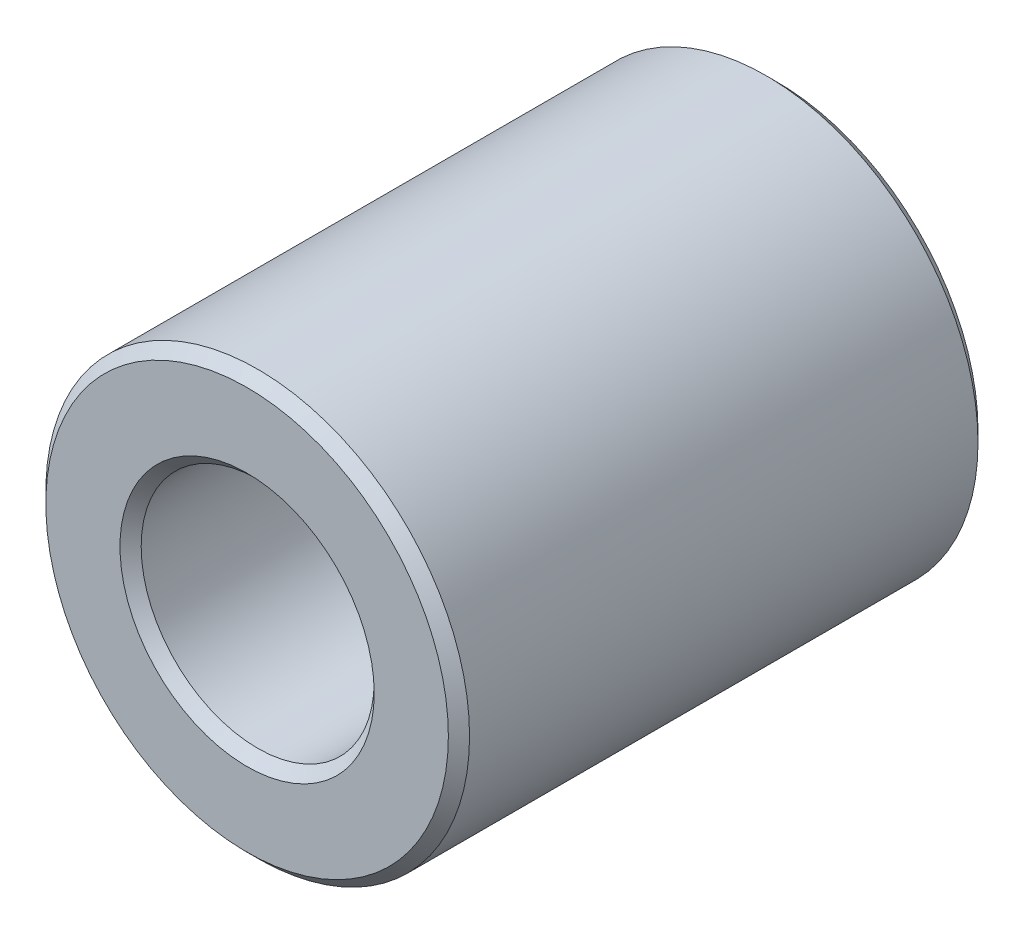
ISO-10303-21;
HEADER;
FILE_DESCRIPTION(('STEP AP214'),'2;1');
FILE_NAME('part.step','',(''),(''),'','','');
FILE_SCHEMA(('AUTOMOTIVE_DESIGN { 1 0 10303 214 1 1 1 1 }'));
ENDSEC;
DATA;
#1=APPLICATION_CONTEXT('core data for automotive mechanical design processes');
#2=APPLICATION_PROTOCOL_DEFINITION('international standard','automotive_design',2000,#1);
#3=PRODUCT_CONTEXT('',#1,'mechanical');
#4=PRODUCT('Part','Part','',(#3));
#5=PRODUCT_RELATED_PRODUCT_CATEGORY('part','',(#4));
#6=PRODUCT_DEFINITION_FORMATION('','',#4);
#7=PRODUCT_DEFINITION_CONTEXT('part definition',#1,'design');
#8=PRODUCT_DEFINITION('design','',#6,#7);
#9=PRODUCT_DEFINITION_SHAPE('','',#8);
#10=(LENGTH_UNIT() NAMED_UNIT(*) SI_UNIT(.MILLI.,.METRE.));
#11=(NAMED_UNIT(*) PLANE_ANGLE_UNIT() SI_UNIT($,.RADIAN.));
#12=(NAMED_UNIT(*) SI_UNIT($,.STERADIAN.) SOLID_ANGLE_UNIT());
#13=UNCERTAINTY_MEASURE_WITH_UNIT(LENGTH_MEASURE(1.E-05),#10,'distance_accuracy_value','');
#14=(GEOMETRIC_REPRESENTATION_CONTEXT(3) GLOBAL_UNCERTAINTY_ASSIGNED_CONTEXT((#13)) GLOBAL_UNIT_ASSIGNED_CONTEXT((#10,
#11,#12)) REPRESENTATION_CONTEXT('',''));
#15=CARTESIAN_POINT('',(0.,0.,0.));
#16=DIRECTION('',(0.,0.,1.));
#17=DIRECTION('',(1.,0.,0.));
#18=AXIS2_PLACEMENT_3D('',#15,#16,#17);
#19=CARTESIAN_POINT('',(0.,0.,2.5));
#20=DIRECTION('',(0.,0.,1.));
#21=DIRECTION('',(1.,0.,0.));
#22=AXIS2_PLACEMENT_3D('',#19,#20,#21);
#23=PLANE('',#22);
#24=CARTESIAN_POINT('',(0.,0.,2.5));
#25=DIRECTION('',(0.,0.,1.));
#26=DIRECTION('',(1.,0.,0.));
#27=AXIS2_PLACEMENT_3D('',#24,#25,#26);
#28=CIRCLE('',#27,1.2);
#29=CARTESIAN_POINT('',(1.2,0.,2.5));
#30=VERTEX_POINT('',#29);
#31=EDGE_CURVE('E10',#30,#30,#28,.F.);
#32=ORIENTED_EDGE('',*,*,#31,.T.);
#33=EDGE_LOOP('',(#32));
#34=FACE_BOUND('',#33,.T.);
#35=CARTESIAN_POINT('',(0.,0.,2.5));
#36=DIRECTION('',(0.,0.,1.));
#37=DIRECTION('',(1.,0.,0.));
#38=AXIS2_PLACEMENT_3D('',#35,#36,#37);
#39=CIRCLE('',#38,1.9);
#40=CARTESIAN_POINT('',(1.9,0.,2.5));
#41=VERTEX_POINT('',#40);
#42=EDGE_CURVE('E45',#41,#41,#39,.T.);
#43=ORIENTED_EDGE('',*,*,#42,.T.);
#44=EDGE_LOOP('',(#43));
#45=FACE_BOUND('',#44,.T.);
#46=ADVANCED_FACE('F37',(#34,#45),#23,.T.);
#47=CARTESIAN_POINT('',(0.,0.,-2.5));
#48=DIRECTION('',(0.,0.,1.));
#49=DIRECTION('',(1.,0.,0.));
#50=AXIS2_PLACEMENT_3D('',#47,#48,#49);
#51=PLANE('',#50);
#52=CARTESIAN_POINT('',(0.,0.,-2.5));
#53=DIRECTION('',(0.,0.,1.));
#54=DIRECTION('',(1.,0.,0.));
#55=AXIS2_PLACEMENT_3D('',#52,#53,#54);
#56=CIRCLE('',#55,1.9);
#57=CARTESIAN_POINT('',(1.9,0.,-2.5));
#58=VERTEX_POINT('',#57);
#59=EDGE_CURVE('E64',#58,#58,#56,.F.);
#60=ORIENTED_EDGE('',*,*,#59,.T.);
#61=EDGE_LOOP('',(#60));
#62=FACE_BOUND('',#61,.T.);
#63=CARTESIAN_POINT('',(0.,0.,-2.5));
#64=DIRECTION('',(0.,0.,1.));
#65=DIRECTION('',(1.,0.,0.));
#66=AXIS2_PLACEMENT_3D('',#63,#64,#65);
#67=CIRCLE('',#66,1.2);
#68=CARTESIAN_POINT('',(1.2,0.,-2.5));
#69=VERTEX_POINT('',#68);
#70=EDGE_CURVE('E68',#69,#69,#67,.T.);
#71=ORIENTED_EDGE('',*,*,#70,.T.);
#72=EDGE_LOOP('',(#71));
#73=FACE_BOUND('',#72,.T.);
#74=ADVANCED_FACE('F89',(#62,#73),#51,.F.);
#75=CARTESIAN_POINT('',(0.,0.,2.5));
#76=DIRECTION('',(0.,0.,-1.));
#77=DIRECTION('',(-1.,0.,0.));
#78=AXIS2_PLACEMENT_3D('',#75,#76,#77);
#79=CYLINDRICAL_SURFACE('',#78,2.);
#80=CARTESIAN_POINT('',(0.,0.,-2.4));
#81=DIRECTION('',(0.,0.,1.));
#82=DIRECTION('',(1.,0.,0.));
#83=AXIS2_PLACEMENT_3D('',#80,#81,#82);
#84=CIRCLE('',#83,2.);
#85=CARTESIAN_POINT('',(2.,0.,-2.4));
#86=VERTEX_POINT('',#85);
#87=EDGE_CURVE('E71',#86,#86,#84,.T.);
#88=ORIENTED_EDGE('',*,*,#87,.T.);
#89=EDGE_LOOP('',(#88));
#90=FACE_BOUND('',#89,.T.);
#91=CARTESIAN_POINT('',(0.,0.,2.4));
#92=DIRECTION('',(0.,0.,1.));
#93=DIRECTION('',(1.,0.,0.));
#94=AXIS2_PLACEMENT_3D('',#91,#92,#93);
#95=CIRCLE('',#94,2.);
#96=CARTESIAN_POINT('',(2.,0.,2.4));
#97=VERTEX_POINT('',#96);
#98=EDGE_CURVE('E74',#97,#97,#95,.F.);
#99=ORIENTED_EDGE('',*,*,#98,.T.);
#100=EDGE_LOOP('',(#99));
#101=FACE_BOUND('',#100,.T.);
#102=ADVANCED_FACE('F78',(#90,#101),#79,.T.);
#103=CARTESIAN_POINT('',(0.,0.,2.5));
#104=DIRECTION('',(0.,0.,-1.));
#105=DIRECTION('',(-1.,0.,0.));
#106=AXIS2_PLACEMENT_3D('',#103,#104,#105);
#107=CYLINDRICAL_SURFACE('',#106,1.1);
#108=CARTESIAN_POINT('',(0.,0.,-2.4));
#109=DIRECTION('',(0.,0.,1.));
#110=DIRECTION('',(1.,0.,0.));
#111=AXIS2_PLACEMENT_3D('',#108,#109,#110);
#112=CIRCLE('',#111,1.1);
#113=CARTESIAN_POINT('',(1.1,0.,-2.4));
#114=VERTEX_POINT('',#113);
#115=EDGE_CURVE('E52',#114,#114,#112,.F.);
#116=ORIENTED_EDGE('',*,*,#115,.T.);
#117=EDGE_LOOP('',(#116));
#118=FACE_BOUND('',#117,.T.);
#119=CARTESIAN_POINT('',(0.,0.,2.4));
#120=DIRECTION('',(0.,0.,1.));
#121=DIRECTION('',(1.,0.,0.));
#122=AXIS2_PLACEMENT_3D('',#119,#120,#121);
#123=CIRCLE('',#122,1.1);
#124=CARTESIAN_POINT('',(1.1,0.,2.4));
#125=VERTEX_POINT('',#124);
#126=EDGE_CURVE('E58',#125,#125,#123,.T.);
#127=ORIENTED_EDGE('',*,*,#126,.T.);
#128=EDGE_LOOP('',(#127));
#129=FACE_BOUND('',#128,.T.);
#130=ADVANCED_FACE('F97',(#118,#129),#107,.F.);
#131=CARTESIAN_POINT('',(0.,0.,-2.4));
#132=DIRECTION('',(0.,0.,1.));
#133=DIRECTION('',(1.,0.,0.));
#134=AXIS2_PLACEMENT_3D('',#131,#132,#133);
#135=CONICAL_SURFACE('',#134,2.,0.785398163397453);
#136=ORIENTED_EDGE('',*,*,#59,.F.);
#137=EDGE_LOOP('',(#136));
#138=FACE_BOUND('',#137,.T.);
#139=ORIENTED_EDGE('',*,*,#87,.F.);
#140=EDGE_LOOP('',(#139));
#141=FACE_BOUND('',#140,.T.);
#142=ADVANCED_FACE('F102',(#138,#141),#135,.T.);
#143=CARTESIAN_POINT('',(0.,0.,-2.5));
#144=DIRECTION('',(0.,0.,-1.));
#145=DIRECTION('',(-1.,0.,0.));
#146=AXIS2_PLACEMENT_3D('',#143,#144,#145);
#147=CONICAL_SURFACE('',#146,1.2,0.785398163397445);
#148=ORIENTED_EDGE('',*,*,#115,.F.);
#149=EDGE_LOOP('',(#148));
#150=FACE_BOUND('',#149,.T.);
#151=ORIENTED_EDGE('',*,*,#70,.F.);
#152=EDGE_LOOP('',(#151));
#153=FACE_BOUND('',#152,.T.);
#154=ADVANCED_FACE('F86',(#150,#153),#147,.F.);
#155=CARTESIAN_POINT('',(0.,0.,2.4));
#156=DIRECTION('',(0.,0.,1.));
#157=DIRECTION('',(1.,0.,0.));
#158=AXIS2_PLACEMENT_3D('',#155,#156,#157);
#159=CONICAL_SURFACE('',#158,1.1,0.785398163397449);
#160=ORIENTED_EDGE('',*,*,#31,.F.);
#161=EDGE_LOOP('',(#160));
#162=FACE_BOUND('',#161,.T.);
#163=ORIENTED_EDGE('',*,*,#126,.F.);
#164=EDGE_LOOP('',(#163));
#165=FACE_BOUND('',#164,.T.);
#166=ADVANCED_FACE('F82',(#162,#165),#159,.F.);
#167=CARTESIAN_POINT('',(0.,0.,2.5));
#168=DIRECTION('',(0.,0.,-1.));
#169=DIRECTION('',(-1.,0.,0.));
#170=AXIS2_PLACEMENT_3D('',#167,#168,#169);
#171=CONICAL_SURFACE('',#170,1.9,0.785398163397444);
#172=ORIENTED_EDGE('',*,*,#98,.F.);
#173=EDGE_LOOP('',(#172));
#174=FACE_BOUND('',#173,.T.);
#175=ORIENTED_EDGE('',*,*,#42,.F.);
#176=EDGE_LOOP('',(#175));
#177=FACE_BOUND('',#176,.T.);
#178=ADVANCED_FACE('F39',(#174,#177),#171,.T.);
#179=CLOSED_SHELL('',(#46,#74,#102,#130,#142,#154,#166,#178));
#180=MANIFOLD_SOLID_BREP('B2',#179);
#181=ADVANCED_BREP_SHAPE_REPRESENTATION('',(#18,#180),#14);
#182=SHAPE_DEFINITION_REPRESENTATION(#9,#181);
ENDSEC;
END-ISO-10303-21;
